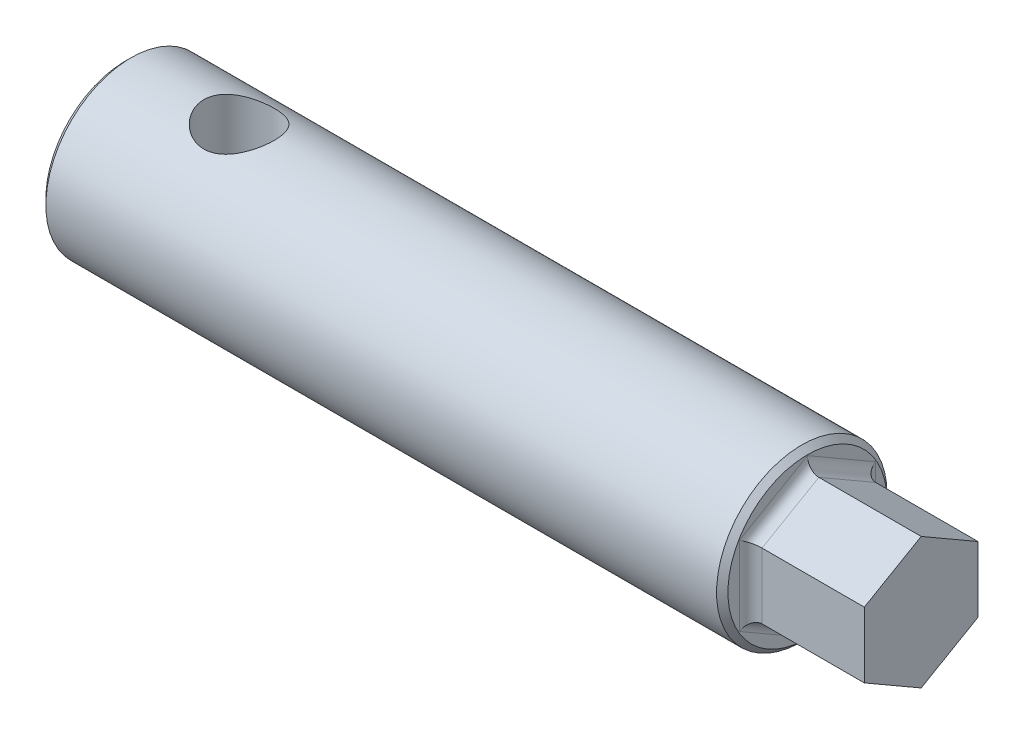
from build123d import *

# Parameters (mm, degrees)
SKIZZE1_R                        = 7.5
AUFSATZ_LINEAR_AUSTRAGEN1_DEPTH  = 60
F_6_2_6_2_DURCHMESSER_BOHRUNG1_D = 6.2
AUFSATZ_LINEAR_AUSTRAGEN2_DEPTH  = 10
VERRUNDUNG1_R                    = 1
FASE1_SIZE                       = 0.5


with BuildPart() as part:
    # Skizze1 → Aufsatz-Linear austragen1 (new body)
    with BuildSketch(Plane(origin=(0, 0, 0), x_dir=(0, 0, -1), z_dir=(1, 0, 0))):
        Circle(SKIZZE1_R)
    extrude(amount=AUFSATZ_LINEAR_AUSTRAGEN1_DEPTH)

    # 6.2 _6.2_ Durchmesser Bohrung1 (through all)
    with Locations(Plane(origin=(10, 7.5, 0), x_dir=(0, 0, 1), z_dir=(0, 1, 0))):
        with Locations((0, 0)):
            Hole(F_6_2_6_2_DURCHMESSER_BOHRUNG1_D / 2)

    # Skizze4 → Aufsatz-Linear austragen2 (add)
    with BuildSketch(Plane(origin=(60, 0, 0), x_dir=(0, 0, -1), z_dir=(1, 0, 0))):
        Polygon((0, 5.773502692), (-5, 2.886751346), (-5, -2.886751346), (0, -5.773502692), (5, -2.886751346), (5, 2.886751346), align=None)
    extrude(amount=AUFSATZ_LINEAR_AUSTRAGEN2_DEPTH)

    # Verrundung1
    verrundung1_edges = [part.edges().sort_by_distance(p)[0] for p in [
        (60, 4.330127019, -2.5),
        (60, 4.330127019, 2.5),
        (60, 0, 5),
        (60, -4.330127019, 2.5),
        (60, -4.330127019, -2.5),
        (60, 0, -5),
    ]]
    fillet(verrundung1_edges, radius=VERRUNDUNG1_R)

    # Fase1
    fase1_edges = [part.edges().sort_by_distance(p)[0] for p in [
        (0, 0, 7.5),
        (60, 0, 7.5),
    ]]
    chamfer(fase1_edges, length=FASE1_SIZE)


solid = part.part
